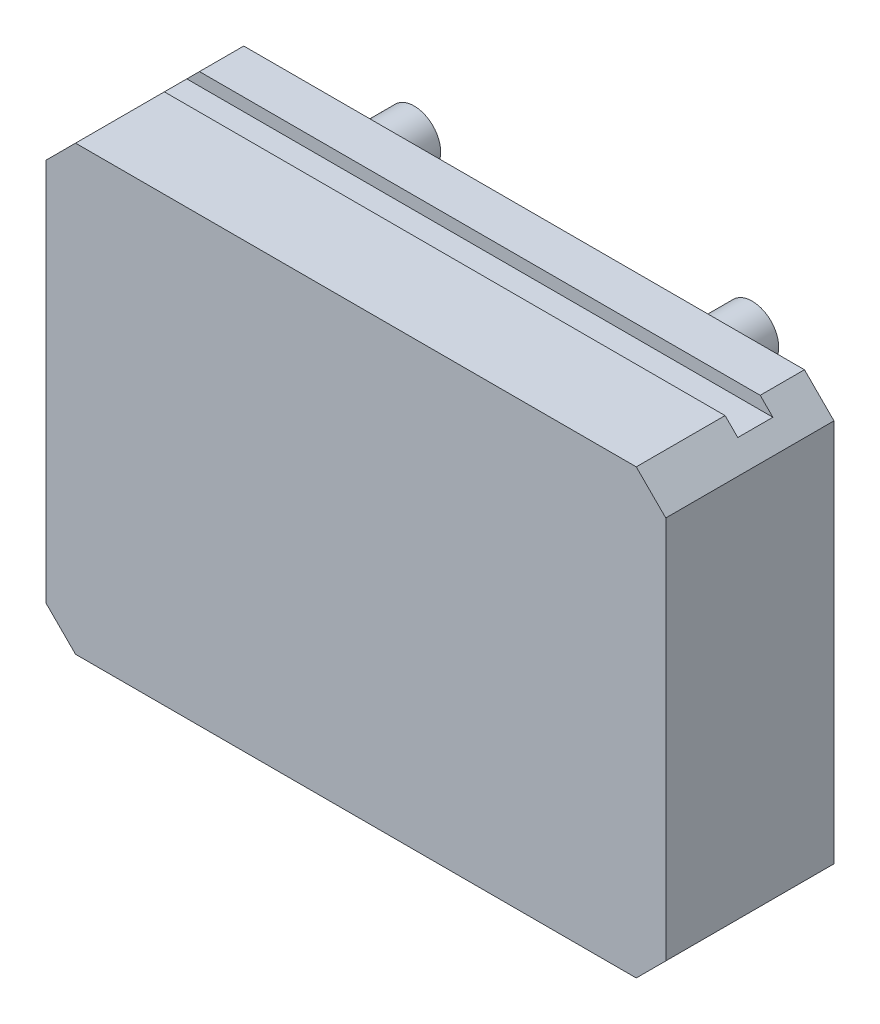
from build123d import *

# Parameters (mm, degrees)
SKICA1_W                 = 210
SKICA1_H                 = 150
VYSUNOUT1_DEPTH          = 57
ZKOSIT1_SIZE             = 10
SKICA2_W                 = 210
SKICA2_H                 = 11.9
ODEBRAT_VYSUNUT_M1_DEPTH = 4.3
SKICA6_R                 = 7.5
VYSUNOUT4_DEPTH          = 10


with BuildPart() as part:
    # Skica1 → Vysunout1 (new body)
    with BuildSketch(Plane.XY):
        Rectangle(SKICA1_W, SKICA1_H)
    extrude(amount=VYSUNOUT1_DEPTH)

    # Zkosit1
    zkosit1_edges = [part.edges().sort_by_distance(p)[0] for p in [
        (-105, 75, 28.5),
        (105, 75, 28.5),
        (105, -75, 28.5),
        (-105, -75, 28.5),
    ]]
    chamfer(zkosit1_edges, length=ZKOSIT1_SIZE)

    # Skica2 → Odebrat vysunut_m1 (cut)
    with BuildSketch(Plane.XZ.offset(75)):
        with Locations((0, 20.95)):
            Rectangle(SKICA2_W, SKICA2_H)
    odebrat_vysunut_m1 = extrude(amount=-ODEBRAT_VYSUNUT_M1_DEPTH, mode=Mode.SUBTRACT)

    # Zrcadlit1: Odebrat vysunut_m1 across plane
    add(odebrat_vysunut_m1.mirror(Plane.ZX), mode=Mode.SUBTRACT)

    # Skica7 → Rotovat1 (revolve)
    with BuildSketch(Plane(origin=(57.275649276, 0, 0), x_dir=(0, 0, -1), z_dir=(1, 0, 0)), mode=Mode.PRIVATE) as rotovat1_sk:
        Polygon((0, -57.275649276), (0, -67.275649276), (3, -67.275649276), (4, -66.275649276), (20, -66.275649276), (20, -57.275649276), align=None)
    rotovat1 = revolve(rotovat1_sk.sketch.rotate(Axis((57.275649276, -57.275649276, 0), (0, 0, -1)), 270), axis=Axis((57.275649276, -57.275649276, 0), (0, 0, -1)))

    # Zrcadlit2: Rotovat1 across plane
    add(rotovat1.mirror(Plane(origin=(0, 0, 0), x_dir=(0, 0, 1), z_dir=(1, 0, 0))))

    # Zrcadlit3: Rotovat1 across plane
    add(rotovat1.mirror(Plane.ZX))

    # Zrcadlit3 copy 1 sketch → Zrcadlit3 copy 1 (revolve)
    with BuildSketch(Plane(origin=(-57.275649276, 0, 0), x_dir=(0, 0, -1), z_dir=(-1, 0, 0))):
        Polygon((0, -57.275649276), (0, -67.275649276), (3, -67.275649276), (4, -66.275649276), (20, -66.275649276), (20, -57.275649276), align=None)
    revolve(axis=Axis((-57.275649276, 57.275649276, 0), (0, 0, -1)))

    # Skica6 → Vysunout4 (add)
    with BuildSketch(Plane.ZY.offset(105)):
        with Locations(Location((38.2, 0, 0), (0, 0, 180))):
            Circle(SKICA6_R)
    extrude(amount=VYSUNOUT4_DEPTH)


solid = part.part
